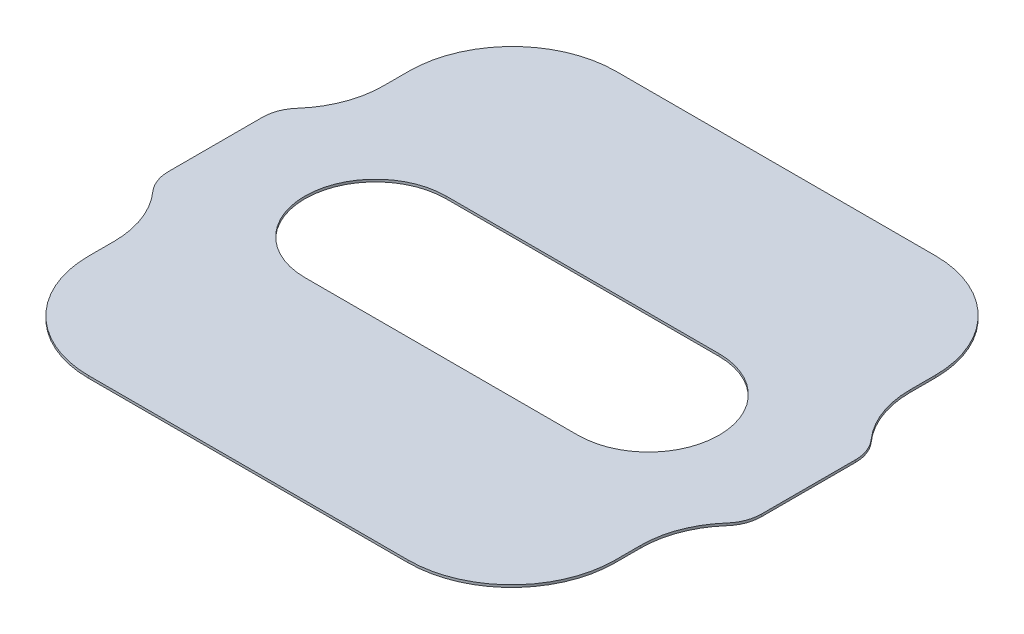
from build123d import *

# Parameters (mm, degrees)
BOSS_EXTRUDE3_DEPTH = 0.0254
CUT_EXTRUDE2_DEPTH  = 24.721123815


with BuildPart() as part:
    # Sketch3 → Boss-Extrude3 (new body)
    with BuildSketch(Plane(origin=(0, 0, 0), x_dir=(1, 0, 0), z_dir=(0, 1, 0))):
        with BuildLine():
            Line((20.641488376, -3.030751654), (17.249062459, -3.030751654))
            ThreePointArc((17.249062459, -3.030751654), (16.471324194, -3.352855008), (16.149062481, -4.130527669))
            Line((16.149062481, -4.130527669), (16.149007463, -4.400727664))
            ThreePointArc((16.149007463, -4.400727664), (16.083672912, -4.756052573), (15.896341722, -5.064972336))
            ThreePointArc((15.896341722, -5.064972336), (15.821394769, -5.188578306), (15.795275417, -5.330751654))
            Line((15.795275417, -5.330751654), (15.795275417, -6.330751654))
            ThreePointArc((15.795275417, -6.330751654), (15.821394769, -6.472925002), (15.896341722, -6.596530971))
            ThreePointArc((15.896341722, -6.596530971), (16.083672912, -6.905450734), (16.149007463, -7.260775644))
            Line((16.149007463, -7.260775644), (16.149062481, -7.530975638))
            ThreePointArc((16.149062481, -7.530975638), (16.471324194, -8.308648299), (17.249062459, -8.630751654))
            Line((17.249062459, -8.630751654), (20.641488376, -8.630751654))
            ThreePointArc((20.641488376, -8.630751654), (21.419226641, -8.308648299), (21.741488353, -7.530975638))
            Line((21.741488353, -7.530975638), (21.741543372, -7.260775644))
            ThreePointArc((21.741543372, -7.260775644), (21.806877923, -6.905450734), (21.994209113, -6.596530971))
            ThreePointArc((21.994209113, -6.596530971), (22.069156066, -6.472925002), (22.095275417, -6.330751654))
            Line((22.095275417, -6.330751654), (22.095275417, -5.330751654))
            ThreePointArc((22.095275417, -5.330751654), (22.069156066, -5.188578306), (21.994209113, -5.064972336))
            ThreePointArc((21.994209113, -5.064972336), (21.806877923, -4.756052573), (21.741543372, -4.400727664))
            Line((21.741543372, -4.400727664), (21.741488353, -4.130527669))
            ThreePointArc((21.741488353, -4.130527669), (21.419226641, -3.352855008), (20.641488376, -3.030751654))
        make_face()
    extrude(amount=BOSS_EXTRUDE3_DEPTH)

    # Sketch4 → Cut-Extrude2 (cut, through all)
    with BuildSketch(Plane(origin=(0, 0.0254, 0), x_dir=(1, 0, 0), z_dir=(0, 1, 0))):
        with BuildLine():
            Line((17.495275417, -5.080751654), (20.395275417, -5.080751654))
            ThreePointArc((20.395275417, -5.080751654), (21.145275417, -5.830751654), (20.395275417, -6.580751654))
            Line((20.395275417, -6.580751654), (17.495275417, -6.580751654))
            ThreePointArc((17.495275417, -6.580751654), (16.745275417, -5.830751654), (17.495275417, -5.080751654))
        make_face()
    extrude(amount=-CUT_EXTRUDE2_DEPTH, mode=Mode.SUBTRACT)


solid = part.part
